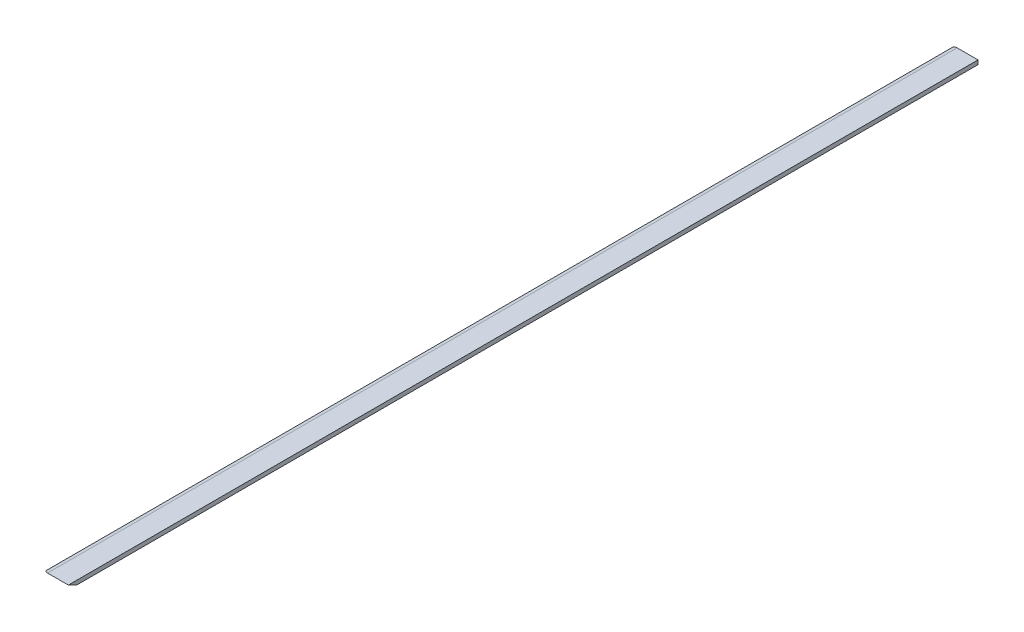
from build123d import *

# Parameters (mm, degrees)
EXTRUSION1_DEPTH        = 2750
ENL_V_MAT_EXTRU_2_DEPTH = 100


with BuildPart() as part:
    # Esquisse1 → Extrusion1 (new body)
    with BuildSketch(Plane.XY):
        with BuildLine():
            Line((0, 0), (0, 60))
            ThreePointArc((0, 60), (5.857864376, 74.142135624), (20, 80))
            Line((20, 80), (80, 80))
            Line((80, 80), (80, 68))
            Line((80, 68), (20, 68))
            ThreePointArc((20, 68), (14.343145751, 65.656854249), (12, 60))
            Line((12, 60), (12, 0))
            Line((12, 0), (0, 0))
        make_face()
    extrude(amount=EXTRUSION1_DEPTH)

    # Esquisse3 → Enl_v. mat.-Extru.2 (cut)
    with BuildSketch(Plane.ZY):
        Polygon((2750, 0), (2750, 140), (2450, 0), align=None)
    extrude(amount=-ENL_V_MAT_EXTRU_2_DEPTH, mode=Mode.SUBTRACT)


solid = part.part
